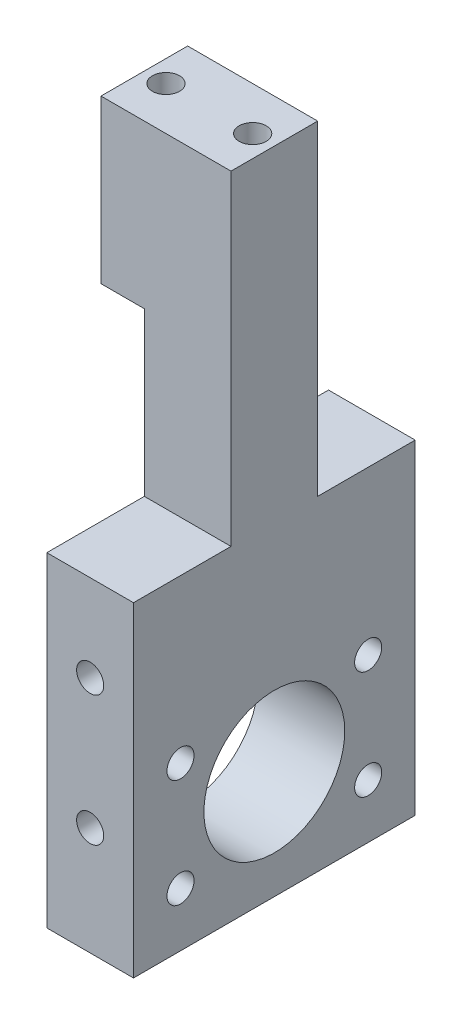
from build123d import *

# Parameters (mm, degrees)
SKETCH1_R                 = 6.5
BOSS_EXTRUDE1_DEPTH       = 12
M3X0_5_TAPPED_HOLE1_D     = 2.5
M3X0_5_TAPPED_HOLE1_DEPTH = 8.5
M3X0_5_TAPPED_HOLE1_TIP   = 0.751075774
SKETCH8_W                 = 4
SKETCH8_H                 = 45
CUT_EXTRUDE2_DEPTH        = 58.619441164
M3X0_5_TAPPED_HOLE2_D     = 2.5
M3X0_5_TAPPED_HOLE3_D     = 2.5
M3X0_5_TAPPED_HOLE3_DEPTH = 7.5
M3X0_5_TAPPED_HOLE3_TIP   = 0.751075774


with BuildPart() as part:
    # Sketch1 → Boss-Extrude1 (new body)
    with BuildSketch(Plane(origin=(0, 0, 0), x_dir=(0, 0, -1), z_dir=(1, 0, 0))):
        Polygon((-13, -10), (13, -10), (13, 20), (4, 20), (4, 50), (-4, 50), (-4, 20), (-13, 20), align=None)
        Circle(SKETCH1_R, mode=Mode.SUBTRACT)
    extrude(amount=BOSS_EXTRUDE1_DEPTH)

    # M3x0.5 Tapped Hole1
    with Locations(Plane(origin=(0, 50, 0), x_dir=(1, 0, 0), z_dir=(0, 1, 0))):
        with Locations((2, 0), (10, 0)):
            Hole(M3X0_5_TAPPED_HOLE1_D / 2, depth=M3X0_5_TAPPED_HOLE1_DEPTH)
            with Locations((0, 0, -(M3X0_5_TAPPED_HOLE1_DEPTH + M3X0_5_TAPPED_HOLE1_TIP / 2))):  # 118° drill point
                Cone(0, M3X0_5_TAPPED_HOLE1_D / 2, M3X0_5_TAPPED_HOLE1_TIP, mode=Mode.SUBTRACT)

    # Sketch8 → Cut-Extrude2 (cut, through all)
    with BuildSketch(Plane(origin=(0, 0, -13), x_dir=(-1, 0, 0), z_dir=(0, 0, -1))):
        with Locations((-2, 12.5)):
            Rectangle(SKETCH8_W, SKETCH8_H)
    extrude(amount=-CUT_EXTRUDE2_DEPTH, mode=Mode.SUBTRACT)

    # M3x0.5 Tapped Hole2 (through all)
    with Locations(Plane(origin=(12, 0, 0), x_dir=(0, 0, -1), z_dir=(1, 0, 0))):
        with Locations((-8.660254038, 5), (-8.660254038, -5), (8.660254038, -5), (8.660254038, 5)):
            Hole(M3X0_5_TAPPED_HOLE2_D / 2)

    # M3x0.5 Tapped Hole3
    with Locations(Plane.XY.offset(13)):
        with Locations((8, 0), (8, 12)):
            Hole(M3X0_5_TAPPED_HOLE3_D / 2, depth=M3X0_5_TAPPED_HOLE3_DEPTH)
            with Locations((0, 0, -(M3X0_5_TAPPED_HOLE3_DEPTH + M3X0_5_TAPPED_HOLE3_TIP / 2))):  # 118° drill point
                Cone(0, M3X0_5_TAPPED_HOLE3_D / 2, M3X0_5_TAPPED_HOLE3_TIP, mode=Mode.SUBTRACT)


solid = part.part
